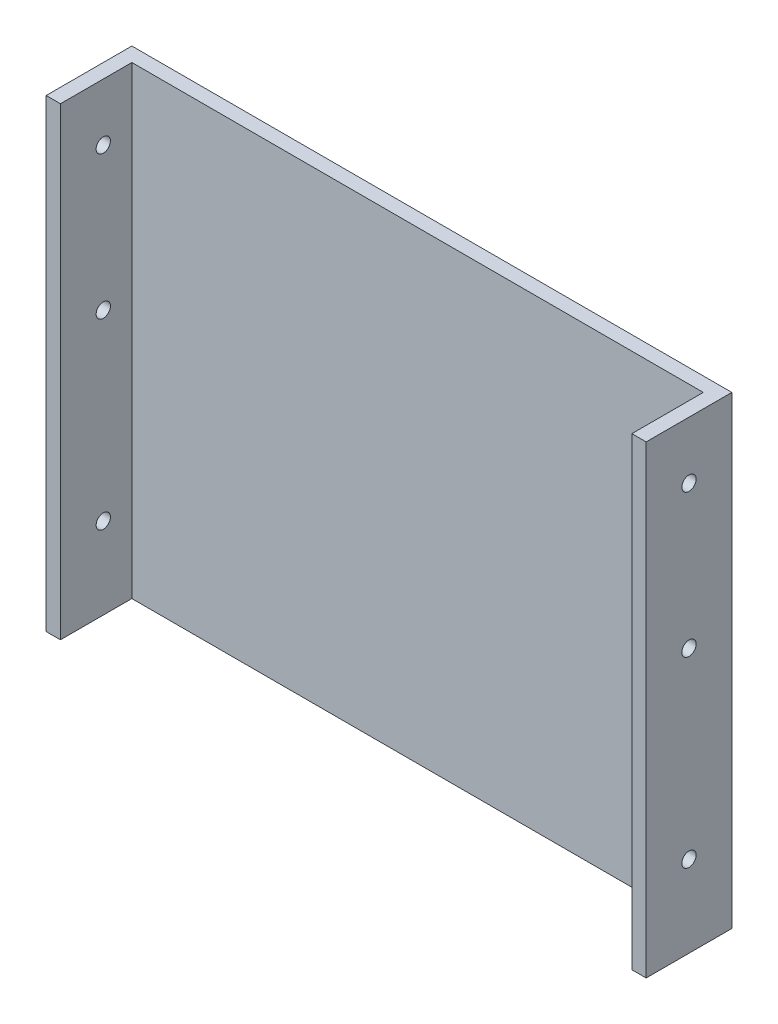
ISO-10303-21;
HEADER;
FILE_DESCRIPTION(('STEP AP214'),'2;1');
FILE_NAME('part.step','',(''),(''),'','','');
FILE_SCHEMA(('AUTOMOTIVE_DESIGN { 1 0 10303 214 1 1 1 1 }'));
ENDSEC;
DATA;
#1=APPLICATION_CONTEXT('core data for automotive mechanical design processes');
#2=APPLICATION_PROTOCOL_DEFINITION('international standard','automotive_design',2000,#1);
#3=PRODUCT_CONTEXT('',#1,'mechanical');
#4=PRODUCT('Part','Part','',(#3));
#5=PRODUCT_RELATED_PRODUCT_CATEGORY('part','',(#4));
#6=PRODUCT_DEFINITION_FORMATION('','',#4);
#7=PRODUCT_DEFINITION_CONTEXT('part definition',#1,'design');
#8=PRODUCT_DEFINITION('design','',#6,#7);
#9=PRODUCT_DEFINITION_SHAPE('','',#8);
#10=(LENGTH_UNIT() NAMED_UNIT(*) SI_UNIT(.MILLI.,.METRE.));
#11=(NAMED_UNIT(*) PLANE_ANGLE_UNIT() SI_UNIT($,.RADIAN.));
#12=(NAMED_UNIT(*) SI_UNIT($,.STERADIAN.) SOLID_ANGLE_UNIT());
#13=UNCERTAINTY_MEASURE_WITH_UNIT(LENGTH_MEASURE(1.E-05),#10,'distance_accuracy_value','');
#14=(GEOMETRIC_REPRESENTATION_CONTEXT(3) GLOBAL_UNCERTAINTY_ASSIGNED_CONTEXT((#13)) GLOBAL_UNIT_ASSIGNED_CONTEXT((#10,
#11,#12)) REPRESENTATION_CONTEXT('',''));
#15=CARTESIAN_POINT('',(0.,0.,0.));
#16=DIRECTION('',(0.,0.,1.));
#17=DIRECTION('',(1.,0.,0.));
#18=AXIS2_PLACEMENT_3D('',#15,#16,#17);
#19=CARTESIAN_POINT('',(42.,32.5,2.));
#20=DIRECTION('',(-1.,0.,0.));
#21=DIRECTION('',(0.,-1.,0.));
#22=AXIS2_PLACEMENT_3D('',#19,#20,#21);
#23=PLANE('',#22);
#24=CARTESIAN_POINT('',(42.,24.5,5.99999999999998));
#25=DIRECTION('',(-1.,0.,0.));
#26=DIRECTION('',(0.,-1.,0.));
#27=AXIS2_PLACEMENT_3D('',#24,#25,#26);
#28=CIRCLE('',#27,0.999999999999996);
#29=CARTESIAN_POINT('',(42.,23.5,5.99999999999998));
#30=VERTEX_POINT('',#29);
#31=EDGE_CURVE('E243',#30,#30,#28,.F.);
#32=ORIENTED_EDGE('',*,*,#31,.F.);
#33=EDGE_LOOP('',(#32));
#34=FACE_BOUND('',#33,.T.);
#35=CARTESIAN_POINT('',(42.,-21.0951452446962,5.99999999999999));
#36=DIRECTION('',(-1.,0.,0.));
#37=DIRECTION('',(0.,-1.,0.));
#38=AXIS2_PLACEMENT_3D('',#35,#36,#37);
#39=CIRCLE('',#38,0.999999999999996);
#40=CARTESIAN_POINT('',(42.,-22.0951452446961,5.99999999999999));
#41=VERTEX_POINT('',#40);
#42=EDGE_CURVE('E247',#41,#41,#39,.F.);
#43=ORIENTED_EDGE('',*,*,#42,.F.);
#44=EDGE_LOOP('',(#43));
#45=FACE_BOUND('',#44,.T.);
#46=CARTESIAN_POINT('',(42.,4.48535256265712,5.99999999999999));
#47=DIRECTION('',(-1.,0.,0.));
#48=DIRECTION('',(0.,-1.,0.));
#49=AXIS2_PLACEMENT_3D('',#46,#47,#48);
#50=CIRCLE('',#49,0.999999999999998);
#51=CARTESIAN_POINT('',(42.,3.48535256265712,5.99999999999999));
#52=VERTEX_POINT('',#51);
#53=EDGE_CURVE('E250',#52,#52,#50,.F.);
#54=ORIENTED_EDGE('',*,*,#53,.F.);
#55=EDGE_LOOP('',(#54));
#56=FACE_BOUND('',#55,.T.);
#57=DIRECTION('',(0.,1.,0.));
#58=VECTOR('',#57,1.);
#59=CARTESIAN_POINT('',(42.,32.5,0.));
#60=LINE('',#59,#58);
#61=CARTESIAN_POINT('',(42.,-32.5,0.));
#62=VERTEX_POINT('',#61);
#63=CARTESIAN_POINT('',(42.,32.5,0.));
#64=VERTEX_POINT('',#63);
#65=EDGE_CURVE('E153',#62,#64,#60,.T.);
#66=ORIENTED_EDGE('',*,*,#65,.T.);
#67=DIRECTION('',(0.,0.,-1.));
#68=VECTOR('',#67,1.);
#69=CARTESIAN_POINT('',(42.,32.5,2.));
#70=LINE('',#69,#68);
#71=CARTESIAN_POINT('',(42.,32.5,12.));
#72=VERTEX_POINT('',#71);
#73=EDGE_CURVE('E11',#72,#64,#70,.T.);
#74=ORIENTED_EDGE('',*,*,#73,.F.);
#75=DIRECTION('',(0.,1.,0.));
#76=VECTOR('',#75,1.);
#77=CARTESIAN_POINT('',(42.,32.5,12.));
#78=LINE('',#77,#76);
#79=CARTESIAN_POINT('',(42.,-32.5,12.));
#80=VERTEX_POINT('',#79);
#81=EDGE_CURVE('E165',#80,#72,#78,.T.);
#82=ORIENTED_EDGE('',*,*,#81,.F.);
#83=DIRECTION('',(0.,0.,-1.));
#84=VECTOR('',#83,1.);
#85=CARTESIAN_POINT('',(42.,-32.5,2.));
#86=LINE('',#85,#84);
#87=EDGE_CURVE('E119',#80,#62,#86,.T.);
#88=ORIENTED_EDGE('',*,*,#87,.T.);
#89=EDGE_LOOP('',(#66,#74,#82,#88));
#90=FACE_BOUND('',#89,.T.);
#91=ADVANCED_FACE('F44',(#34,#45,#56,#90),#23,.F.);
#92=CARTESIAN_POINT('',(-42.,32.5,2.));
#93=DIRECTION('',(0.,-1.,0.));
#94=DIRECTION('',(0.,0.,-1.));
#95=AXIS2_PLACEMENT_3D('',#92,#93,#94);
#96=PLANE('',#95);
#97=DIRECTION('',(-1.,0.,0.));
#98=VECTOR('',#97,1.);
#99=CARTESIAN_POINT('',(-42.,32.5,0.));
#100=LINE('',#99,#98);
#101=CARTESIAN_POINT('',(-42.,32.5,0.));
#102=VERTEX_POINT('',#101);
#103=EDGE_CURVE('E188',#64,#102,#100,.T.);
#104=ORIENTED_EDGE('',*,*,#103,.T.);
#105=DIRECTION('',(0.,0.,-1.));
#106=VECTOR('',#105,1.);
#107=CARTESIAN_POINT('',(-42.,32.5,2.));
#108=LINE('',#107,#106);
#109=CARTESIAN_POINT('',(-42.,32.5,12.));
#110=VERTEX_POINT('',#109);
#111=EDGE_CURVE('E52',#110,#102,#108,.T.);
#112=ORIENTED_EDGE('',*,*,#111,.F.);
#113=DIRECTION('',(-1.,0.,0.));
#114=VECTOR('',#113,1.);
#115=CARTESIAN_POINT('',(-42.,32.5,12.));
#116=LINE('',#115,#114);
#117=CARTESIAN_POINT('',(-40.,32.5,12.));
#118=VERTEX_POINT('',#117);
#119=EDGE_CURVE('E134',#118,#110,#116,.T.);
#120=ORIENTED_EDGE('',*,*,#119,.F.);
#121=DIRECTION('',(0.,0.,-1.));
#122=VECTOR('',#121,1.);
#123=CARTESIAN_POINT('',(-40.,32.5,12.));
#124=LINE('',#123,#122);
#125=CARTESIAN_POINT('',(-40.,32.5,2.));
#126=VERTEX_POINT('',#125);
#127=EDGE_CURVE('E146',#118,#126,#124,.T.);
#128=ORIENTED_EDGE('',*,*,#127,.T.);
#129=DIRECTION('',(-1.,0.,0.));
#130=VECTOR('',#129,1.);
#131=CARTESIAN_POINT('',(-42.,32.5,2.));
#132=LINE('',#131,#130);
#133=CARTESIAN_POINT('',(40.,32.5,2.));
#134=VERTEX_POINT('',#133);
#135=EDGE_CURVE('E178',#134,#126,#132,.T.);
#136=ORIENTED_EDGE('',*,*,#135,.F.);
#137=DIRECTION('',(0.,0.,-1.));
#138=VECTOR('',#137,1.);
#139=CARTESIAN_POINT('',(40.,32.5,12.));
#140=LINE('',#139,#138);
#141=CARTESIAN_POINT('',(40.,32.5,12.));
#142=VERTEX_POINT('',#141);
#143=EDGE_CURVE('E154',#142,#134,#140,.T.);
#144=ORIENTED_EDGE('',*,*,#143,.F.);
#145=DIRECTION('',(-1.,0.,0.));
#146=VECTOR('',#145,1.);
#147=CARTESIAN_POINT('',(42.,32.5,12.));
#148=LINE('',#147,#146);
#149=EDGE_CURVE('E172',#72,#142,#148,.T.);
#150=ORIENTED_EDGE('',*,*,#149,.F.);
#151=ORIENTED_EDGE('',*,*,#73,.T.);
#152=EDGE_LOOP('',(#104,#112,#120,#128,#136,#144,#150,#151));
#153=FACE_BOUND('',#152,.T.);
#154=ADVANCED_FACE('F213',(#153),#96,.F.);
#155=CARTESIAN_POINT('',(-42.,32.5,2.));
#156=DIRECTION('',(1.,0.,0.));
#157=DIRECTION('',(0.,1.,0.));
#158=AXIS2_PLACEMENT_3D('',#155,#156,#157);
#159=PLANE('',#158);
#160=CARTESIAN_POINT('',(-42.,24.5,5.99999999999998));
#161=DIRECTION('',(1.,0.,0.));
#162=DIRECTION('',(0.,1.,0.));
#163=AXIS2_PLACEMENT_3D('',#160,#161,#162);
#164=CIRCLE('',#163,0.999999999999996);
#165=CARTESIAN_POINT('',(-42.,25.5,5.99999999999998));
#166=VERTEX_POINT('',#165);
#167=EDGE_CURVE('E140',#166,#166,#164,.T.);
#168=ORIENTED_EDGE('',*,*,#167,.T.);
#169=EDGE_LOOP('',(#168));
#170=FACE_BOUND('',#169,.T.);
#171=CARTESIAN_POINT('',(-42.,-21.0951452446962,5.99999999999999));
#172=DIRECTION('',(1.,0.,0.));
#173=DIRECTION('',(0.,1.,0.));
#174=AXIS2_PLACEMENT_3D('',#171,#172,#173);
#175=CIRCLE('',#174,0.999999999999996);
#176=CARTESIAN_POINT('',(-42.,-20.0951452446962,5.99999999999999));
#177=VERTEX_POINT('',#176);
#178=EDGE_CURVE('E280',#177,#177,#175,.T.);
#179=ORIENTED_EDGE('',*,*,#178,.T.);
#180=EDGE_LOOP('',(#179));
#181=FACE_BOUND('',#180,.T.);
#182=CARTESIAN_POINT('',(-42.,4.48535256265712,5.99999999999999));
#183=DIRECTION('',(1.,0.,0.));
#184=DIRECTION('',(0.,1.,0.));
#185=AXIS2_PLACEMENT_3D('',#182,#183,#184);
#186=CIRCLE('',#185,0.999999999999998);
#187=CARTESIAN_POINT('',(-42.,5.48535256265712,5.99999999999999));
#188=VERTEX_POINT('',#187);
#189=EDGE_CURVE('E277',#188,#188,#186,.T.);
#190=ORIENTED_EDGE('',*,*,#189,.T.);
#191=EDGE_LOOP('',(#190));
#192=FACE_BOUND('',#191,.T.);
#193=DIRECTION('',(0.,-1.,0.));
#194=VECTOR('',#193,1.);
#195=CARTESIAN_POINT('',(-42.,32.5,0.));
#196=LINE('',#195,#194);
#197=CARTESIAN_POINT('',(-42.,-32.5,0.));
#198=VERTEX_POINT('',#197);
#199=EDGE_CURVE('E115',#102,#198,#196,.T.);
#200=ORIENTED_EDGE('',*,*,#199,.T.);
#201=DIRECTION('',(0.,0.,-1.));
#202=VECTOR('',#201,1.);
#203=CARTESIAN_POINT('',(-42.,-32.5,2.));
#204=LINE('',#203,#202);
#205=CARTESIAN_POINT('',(-42.,-32.5,12.));
#206=VERTEX_POINT('',#205);
#207=EDGE_CURVE('E108',#206,#198,#204,.T.);
#208=ORIENTED_EDGE('',*,*,#207,.F.);
#209=DIRECTION('',(0.,-1.,0.));
#210=VECTOR('',#209,1.);
#211=CARTESIAN_POINT('',(-42.,32.5,12.));
#212=LINE('',#211,#210);
#213=EDGE_CURVE('E113',#110,#206,#212,.T.);
#214=ORIENTED_EDGE('',*,*,#213,.F.);
#215=ORIENTED_EDGE('',*,*,#111,.T.);
#216=EDGE_LOOP('',(#200,#208,#214,#215));
#217=FACE_BOUND('',#216,.T.);
#218=ADVANCED_FACE('F110',(#170,#181,#192,#217),#159,.F.);
#219=CARTESIAN_POINT('',(-42.,-32.5,2.));
#220=DIRECTION('',(0.,1.,0.));
#221=DIRECTION('',(0.,0.,1.));
#222=AXIS2_PLACEMENT_3D('',#219,#220,#221);
#223=PLANE('',#222);
#224=DIRECTION('',(1.,0.,0.));
#225=VECTOR('',#224,1.);
#226=CARTESIAN_POINT('',(-42.,-32.5,0.));
#227=LINE('',#226,#225);
#228=EDGE_CURVE('E182',#198,#62,#227,.T.);
#229=ORIENTED_EDGE('',*,*,#228,.T.);
#230=ORIENTED_EDGE('',*,*,#87,.F.);
#231=DIRECTION('',(1.,0.,0.));
#232=VECTOR('',#231,1.);
#233=CARTESIAN_POINT('',(42.,-32.5,12.));
#234=LINE('',#233,#232);
#235=CARTESIAN_POINT('',(40.,-32.5,12.));
#236=VERTEX_POINT('',#235);
#237=EDGE_CURVE('E162',#236,#80,#234,.T.);
#238=ORIENTED_EDGE('',*,*,#237,.F.);
#239=DIRECTION('',(0.,0.,-1.));
#240=VECTOR('',#239,1.);
#241=CARTESIAN_POINT('',(40.,-32.5,12.));
#242=LINE('',#241,#240);
#243=CARTESIAN_POINT('',(40.,-32.5,2.));
#244=VERTEX_POINT('',#243);
#245=EDGE_CURVE('E158',#236,#244,#242,.T.);
#246=ORIENTED_EDGE('',*,*,#245,.T.);
#247=DIRECTION('',(1.,0.,0.));
#248=VECTOR('',#247,1.);
#249=CARTESIAN_POINT('',(-42.,-32.5,2.));
#250=LINE('',#249,#248);
#251=CARTESIAN_POINT('',(-40.,-32.5,2.));
#252=VERTEX_POINT('',#251);
#253=EDGE_CURVE('E181',#252,#244,#250,.T.);
#254=ORIENTED_EDGE('',*,*,#253,.F.);
#255=DIRECTION('',(0.,0.,-1.));
#256=VECTOR('',#255,1.);
#257=CARTESIAN_POINT('',(-40.,-32.5,12.));
#258=LINE('',#257,#256);
#259=CARTESIAN_POINT('',(-40.,-32.5,12.));
#260=VERTEX_POINT('',#259);
#261=EDGE_CURVE('E125',#260,#252,#258,.T.);
#262=ORIENTED_EDGE('',*,*,#261,.F.);
#263=DIRECTION('',(1.,0.,0.));
#264=VECTOR('',#263,1.);
#265=CARTESIAN_POINT('',(-42.,-32.5,12.));
#266=LINE('',#265,#264);
#267=EDGE_CURVE('E122',#206,#260,#266,.T.);
#268=ORIENTED_EDGE('',*,*,#267,.F.);
#269=ORIENTED_EDGE('',*,*,#207,.T.);
#270=EDGE_LOOP('',(#229,#230,#238,#246,#254,#262,#268,#269));
#271=FACE_BOUND('',#270,.T.);
#272=ADVANCED_FACE('F123',(#271),#223,.F.);
#273=CARTESIAN_POINT('',(0.,0.,2.));
#274=DIRECTION('',(0.,0.,1.));
#275=DIRECTION('',(1.,0.,0.));
#276=AXIS2_PLACEMENT_3D('',#273,#274,#275);
#277=PLANE('',#276);
#278=DIRECTION('',(0.,1.,0.));
#279=VECTOR('',#278,1.);
#280=CARTESIAN_POINT('',(-40.,32.5,2.));
#281=LINE('',#280,#279);
#282=EDGE_CURVE('E59',#252,#126,#281,.T.);
#283=ORIENTED_EDGE('',*,*,#282,.F.);
#284=ORIENTED_EDGE('',*,*,#253,.T.);
#285=DIRECTION('',(0.,-1.,0.));
#286=VECTOR('',#285,1.);
#287=CARTESIAN_POINT('',(40.,32.5,2.));
#288=LINE('',#287,#286);
#289=EDGE_CURVE('E64',#134,#244,#288,.T.);
#290=ORIENTED_EDGE('',*,*,#289,.F.);
#291=ORIENTED_EDGE('',*,*,#135,.T.);
#292=EDGE_LOOP('',(#283,#284,#290,#291));
#293=FACE_BOUND('',#292,.T.);
#294=ADVANCED_FACE('F215',(#293),#277,.T.);
#295=CARTESIAN_POINT('',(0.,0.,0.));
#296=DIRECTION('',(0.,0.,1.));
#297=DIRECTION('',(1.,0.,0.));
#298=AXIS2_PLACEMENT_3D('',#295,#296,#297);
#299=PLANE('',#298);
#300=ORIENTED_EDGE('',*,*,#65,.F.);
#301=ORIENTED_EDGE('',*,*,#228,.F.);
#302=ORIENTED_EDGE('',*,*,#199,.F.);
#303=ORIENTED_EDGE('',*,*,#103,.F.);
#304=EDGE_LOOP('',(#300,#301,#302,#303));
#305=FACE_BOUND('',#304,.T.);
#306=ADVANCED_FACE('F201',(#305),#299,.F.);
#307=CARTESIAN_POINT('',(40.,32.5,12.));
#308=DIRECTION('',(1.,0.,0.));
#309=DIRECTION('',(0.,1.,0.));
#310=AXIS2_PLACEMENT_3D('',#307,#308,#309);
#311=PLANE('',#310);
#312=CARTESIAN_POINT('',(40.,24.5,5.99999999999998));
#313=DIRECTION('',(1.,0.,0.));
#314=DIRECTION('',(0.,1.,0.));
#315=AXIS2_PLACEMENT_3D('',#312,#313,#314);
#316=CIRCLE('',#315,0.999999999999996);
#317=CARTESIAN_POINT('',(40.,25.5,5.99999999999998));
#318=VERTEX_POINT('',#317);
#319=EDGE_CURVE('E327',#318,#318,#316,.T.);
#320=ORIENTED_EDGE('',*,*,#319,.T.);
#321=EDGE_LOOP('',(#320));
#322=FACE_BOUND('',#321,.T.);
#323=CARTESIAN_POINT('',(40.,-21.0951452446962,5.99999999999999));
#324=DIRECTION('',(1.,0.,0.));
#325=DIRECTION('',(0.,1.,0.));
#326=AXIS2_PLACEMENT_3D('',#323,#324,#325);
#327=CIRCLE('',#326,0.999999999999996);
#328=CARTESIAN_POINT('',(40.,-20.0951452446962,5.99999999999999));
#329=VERTEX_POINT('',#328);
#330=EDGE_CURVE('E259',#329,#329,#327,.T.);
#331=ORIENTED_EDGE('',*,*,#330,.T.);
#332=EDGE_LOOP('',(#331));
#333=FACE_BOUND('',#332,.T.);
#334=CARTESIAN_POINT('',(40.,4.48535256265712,5.99999999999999));
#335=DIRECTION('',(1.,0.,0.));
#336=DIRECTION('',(0.,1.,0.));
#337=AXIS2_PLACEMENT_3D('',#334,#335,#336);
#338=CIRCLE('',#337,0.999999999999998);
#339=CARTESIAN_POINT('',(40.,5.48535256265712,5.99999999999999));
#340=VERTEX_POINT('',#339);
#341=EDGE_CURVE('E253',#340,#340,#338,.T.);
#342=ORIENTED_EDGE('',*,*,#341,.T.);
#343=EDGE_LOOP('',(#342));
#344=FACE_BOUND('',#343,.T.);
#345=ORIENTED_EDGE('',*,*,#289,.T.);
#346=ORIENTED_EDGE('',*,*,#245,.F.);
#347=DIRECTION('',(0.,-1.,0.));
#348=VECTOR('',#347,1.);
#349=CARTESIAN_POINT('',(40.,32.5,12.));
#350=LINE('',#349,#348);
#351=EDGE_CURVE('E169',#142,#236,#350,.T.);
#352=ORIENTED_EDGE('',*,*,#351,.F.);
#353=ORIENTED_EDGE('',*,*,#143,.T.);
#354=EDGE_LOOP('',(#345,#346,#352,#353));
#355=FACE_BOUND('',#354,.T.);
#356=ADVANCED_FACE('F212',(#322,#333,#344,#355),#311,.F.);
#357=CARTESIAN_POINT('',(0.,0.,12.));
#358=DIRECTION('',(0.,0.,-1.));
#359=DIRECTION('',(-1.,0.,0.));
#360=AXIS2_PLACEMENT_3D('',#357,#358,#359);
#361=PLANE('',#360);
#362=ORIENTED_EDGE('',*,*,#81,.T.);
#363=ORIENTED_EDGE('',*,*,#149,.T.);
#364=ORIENTED_EDGE('',*,*,#351,.T.);
#365=ORIENTED_EDGE('',*,*,#237,.T.);
#366=EDGE_LOOP('',(#362,#363,#364,#365));
#367=FACE_BOUND('',#366,.T.);
#368=ADVANCED_FACE('F207',(#367),#361,.F.);
#369=CARTESIAN_POINT('',(-40.,32.5,12.));
#370=DIRECTION('',(-1.,0.,0.));
#371=DIRECTION('',(0.,-1.,0.));
#372=AXIS2_PLACEMENT_3D('',#369,#370,#371);
#373=PLANE('',#372);
#374=CARTESIAN_POINT('',(-40.,24.5,5.99999999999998));
#375=DIRECTION('',(1.,0.,0.));
#376=DIRECTION('',(0.,1.,0.));
#377=AXIS2_PLACEMENT_3D('',#374,#375,#376);
#378=CIRCLE('',#377,0.999999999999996);
#379=CARTESIAN_POINT('',(-40.,25.5,5.99999999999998));
#380=VERTEX_POINT('',#379);
#381=EDGE_CURVE('E265',#380,#380,#378,.T.);
#382=ORIENTED_EDGE('',*,*,#381,.F.);
#383=EDGE_LOOP('',(#382));
#384=FACE_BOUND('',#383,.T.);
#385=CARTESIAN_POINT('',(-40.,-21.0951452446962,5.99999999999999));
#386=DIRECTION('',(1.,0.,0.));
#387=DIRECTION('',(0.,1.,0.));
#388=AXIS2_PLACEMENT_3D('',#385,#386,#387);
#389=CIRCLE('',#388,0.999999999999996);
#390=CARTESIAN_POINT('',(-40.,-20.0951452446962,5.99999999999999));
#391=VERTEX_POINT('',#390);
#392=EDGE_CURVE('E266',#391,#391,#389,.T.);
#393=ORIENTED_EDGE('',*,*,#392,.F.);
#394=EDGE_LOOP('',(#393));
#395=FACE_BOUND('',#394,.T.);
#396=CARTESIAN_POINT('',(-40.,4.48535256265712,5.99999999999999));
#397=DIRECTION('',(1.,0.,0.));
#398=DIRECTION('',(0.,1.,0.));
#399=AXIS2_PLACEMENT_3D('',#396,#397,#398);
#400=CIRCLE('',#399,0.999999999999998);
#401=CARTESIAN_POINT('',(-40.,5.48535256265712,5.99999999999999));
#402=VERTEX_POINT('',#401);
#403=EDGE_CURVE('E270',#402,#402,#400,.T.);
#404=ORIENTED_EDGE('',*,*,#403,.F.);
#405=EDGE_LOOP('',(#404));
#406=FACE_BOUND('',#405,.T.);
#407=ORIENTED_EDGE('',*,*,#282,.T.);
#408=ORIENTED_EDGE('',*,*,#127,.F.);
#409=DIRECTION('',(0.,1.,0.));
#410=VECTOR('',#409,1.);
#411=CARTESIAN_POINT('',(-40.,32.5,12.));
#412=LINE('',#411,#410);
#413=EDGE_CURVE('E129',#260,#118,#412,.T.);
#414=ORIENTED_EDGE('',*,*,#413,.F.);
#415=ORIENTED_EDGE('',*,*,#261,.T.);
#416=EDGE_LOOP('',(#407,#408,#414,#415));
#417=FACE_BOUND('',#416,.T.);
#418=ADVANCED_FACE('F217',(#384,#395,#406,#417),#373,.F.);
#419=CARTESIAN_POINT('',(0.,0.,12.));
#420=DIRECTION('',(0.,0.,1.));
#421=DIRECTION('',(1.,0.,0.));
#422=AXIS2_PLACEMENT_3D('',#419,#420,#421);
#423=PLANE('',#422);
#424=ORIENTED_EDGE('',*,*,#213,.T.);
#425=ORIENTED_EDGE('',*,*,#267,.T.);
#426=ORIENTED_EDGE('',*,*,#413,.T.);
#427=ORIENTED_EDGE('',*,*,#119,.T.);
#428=EDGE_LOOP('',(#424,#425,#426,#427));
#429=FACE_BOUND('',#428,.T.);
#430=ADVANCED_FACE('F132',(#429),#423,.T.);
#431=CARTESIAN_POINT('',(-50.,4.48535256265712,5.99999999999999));
#432=DIRECTION('',(1.,0.,0.));
#433=DIRECTION('',(0.,1.,0.));
#434=AXIS2_PLACEMENT_3D('',#431,#432,#433);
#435=CYLINDRICAL_SURFACE('',#434,0.999999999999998);
#436=ORIENTED_EDGE('',*,*,#403,.T.);
#437=EDGE_LOOP('',(#436));
#438=FACE_BOUND('',#437,.T.);
#439=ORIENTED_EDGE('',*,*,#189,.F.);
#440=EDGE_LOOP('',(#439));
#441=FACE_BOUND('',#440,.T.);
#442=ADVANCED_FACE('F226',(#438,#441),#435,.F.);
#443=CARTESIAN_POINT('',(-50.,-21.0951452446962,5.99999999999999));
#444=DIRECTION('',(1.,0.,0.));
#445=DIRECTION('',(0.,1.,0.));
#446=AXIS2_PLACEMENT_3D('',#443,#444,#445);
#447=CYLINDRICAL_SURFACE('',#446,0.999999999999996);
#448=ORIENTED_EDGE('',*,*,#392,.T.);
#449=EDGE_LOOP('',(#448));
#450=FACE_BOUND('',#449,.T.);
#451=ORIENTED_EDGE('',*,*,#178,.F.);
#452=EDGE_LOOP('',(#451));
#453=FACE_BOUND('',#452,.T.);
#454=ADVANCED_FACE('F292',(#450,#453),#447,.F.);
#455=CARTESIAN_POINT('',(-50.,24.5,5.99999999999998));
#456=DIRECTION('',(1.,0.,0.));
#457=DIRECTION('',(0.,1.,0.));
#458=AXIS2_PLACEMENT_3D('',#455,#456,#457);
#459=CYLINDRICAL_SURFACE('',#458,0.999999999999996);
#460=ORIENTED_EDGE('',*,*,#381,.T.);
#461=EDGE_LOOP('',(#460));
#462=FACE_BOUND('',#461,.T.);
#463=ORIENTED_EDGE('',*,*,#167,.F.);
#464=EDGE_LOOP('',(#463));
#465=FACE_BOUND('',#464,.T.);
#466=ADVANCED_FACE('F290',(#462,#465),#459,.F.);
#467=CARTESIAN_POINT('',(50.,4.48535256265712,5.99999999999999));
#468=DIRECTION('',(-1.,0.,0.));
#469=DIRECTION('',(0.,-1.,0.));
#470=AXIS2_PLACEMENT_3D('',#467,#468,#469);
#471=CYLINDRICAL_SURFACE('',#470,0.999999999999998);
#472=ORIENTED_EDGE('',*,*,#341,.F.);
#473=EDGE_LOOP('',(#472));
#474=FACE_BOUND('',#473,.T.);
#475=ORIENTED_EDGE('',*,*,#53,.T.);
#476=EDGE_LOOP('',(#475));
#477=FACE_BOUND('',#476,.T.);
#478=ADVANCED_FACE('F291',(#474,#477),#471,.F.);
#479=CARTESIAN_POINT('',(50.,-21.0951452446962,5.99999999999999));
#480=DIRECTION('',(-1.,0.,0.));
#481=DIRECTION('',(0.,-1.,0.));
#482=AXIS2_PLACEMENT_3D('',#479,#480,#481);
#483=CYLINDRICAL_SURFACE('',#482,0.999999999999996);
#484=ORIENTED_EDGE('',*,*,#330,.F.);
#485=EDGE_LOOP('',(#484));
#486=FACE_BOUND('',#485,.T.);
#487=ORIENTED_EDGE('',*,*,#42,.T.);
#488=EDGE_LOOP('',(#487));
#489=FACE_BOUND('',#488,.T.);
#490=ADVANCED_FACE('F299',(#486,#489),#483,.F.);
#491=CARTESIAN_POINT('',(50.,24.5,5.99999999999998));
#492=DIRECTION('',(-1.,0.,0.));
#493=DIRECTION('',(0.,-1.,0.));
#494=AXIS2_PLACEMENT_3D('',#491,#492,#493);
#495=CYLINDRICAL_SURFACE('',#494,0.999999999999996);
#496=ORIENTED_EDGE('',*,*,#319,.F.);
#497=EDGE_LOOP('',(#496));
#498=FACE_BOUND('',#497,.T.);
#499=ORIENTED_EDGE('',*,*,#31,.T.);
#500=EDGE_LOOP('',(#499));
#501=FACE_BOUND('',#500,.T.);
#502=ADVANCED_FACE('F338',(#498,#501),#495,.F.);
#503=CLOSED_SHELL('',(#91,#154,#218,#272,#294,#306,#356,#368,#418,#430,#442,#454,#466,#478,#490,#502));
#504=MANIFOLD_SOLID_BREP('B2',#503);
#505=ADVANCED_BREP_SHAPE_REPRESENTATION('',(#18,#504),#14);
#506=SHAPE_DEFINITION_REPRESENTATION(#9,#505);
ENDSEC;
END-ISO-10303-21;
